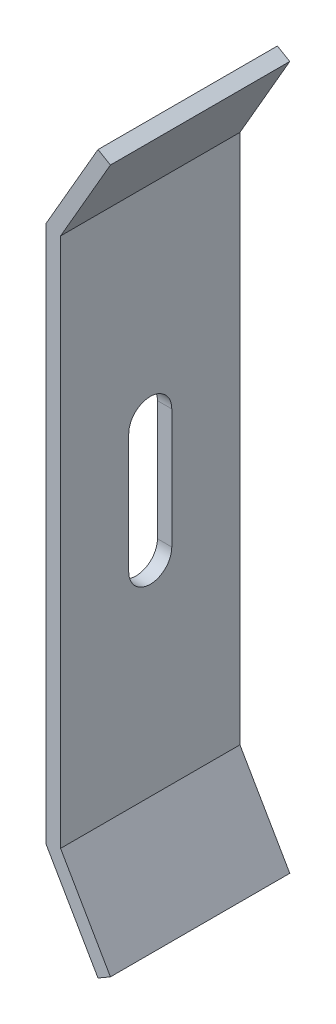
from build123d import *

# Parameters (mm, degrees)
BASE_EXTRUDE_THIN_DEPTH = 19.05
CUT_EXTRUDE1_DEPTH      = 43.924939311


with BuildPart() as part:
    # Sketch1 → Base-Extrude-Thin (new body)
    with BuildSketch(Plane.XY):
        Polygon((5.499261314, 38.1), (0, 28.575), (0, -28.575), (5.499261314, -38.1), (6.819084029, -37.338), (1.524, -28.166645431), (1.524, 28.166645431), (6.819084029, 37.338), align=None)
    extrude(amount=BASE_EXTRUDE_THIN_DEPTH)

    # Sketch2 → Cut-Extrude1 (cut, through all)
    with BuildSketch(Plane(origin=(1.524, 0, 0), x_dir=(0, 0, -1), z_dir=(1, 0, 0))):
        with BuildLine():
            Line((-11.811, 6.35), (-11.811, -6.35))
            ThreePointArc((-11.811, -6.35), (-9.525, -8.636), (-7.239, -6.35))
            Line((-7.239, -6.35), (-7.239, 6.35))
            ThreePointArc((-7.239, 6.35), (-9.525, 8.636), (-11.811, 6.35))
        make_face()
    extrude(amount=-CUT_EXTRUDE1_DEPTH, mode=Mode.SUBTRACT)


solid = part.part
